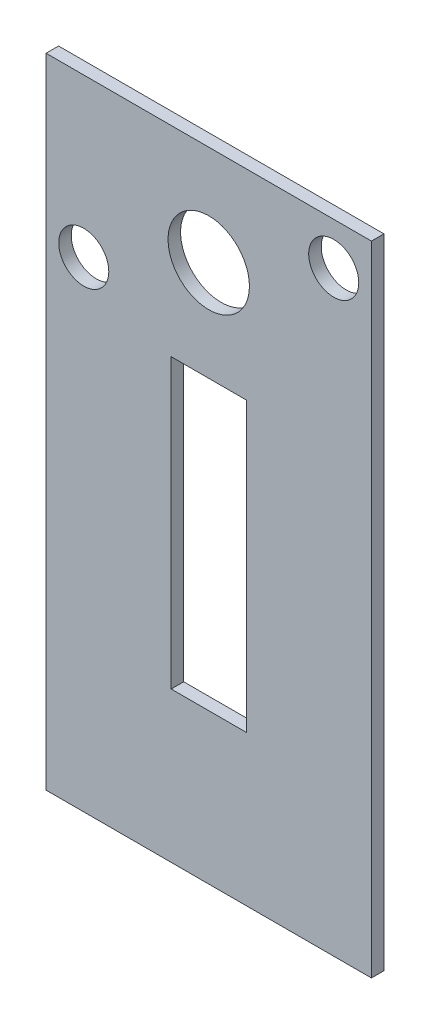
ISO-10303-21;
HEADER;
FILE_DESCRIPTION(('STEP AP214'),'2;1');
FILE_NAME('part.step','',(''),(''),'','','');
FILE_SCHEMA(('AUTOMOTIVE_DESIGN { 1 0 10303 214 1 1 1 1 }'));
ENDSEC;
DATA;
#1=APPLICATION_CONTEXT('core data for automotive mechanical design processes');
#2=APPLICATION_PROTOCOL_DEFINITION('international standard','automotive_design',2000,#1);
#3=PRODUCT_CONTEXT('',#1,'mechanical');
#4=PRODUCT('Part','Part','',(#3));
#5=PRODUCT_RELATED_PRODUCT_CATEGORY('part','',(#4));
#6=PRODUCT_DEFINITION_FORMATION('','',#4);
#7=PRODUCT_DEFINITION_CONTEXT('part definition',#1,'design');
#8=PRODUCT_DEFINITION('design','',#6,#7);
#9=PRODUCT_DEFINITION_SHAPE('','',#8);
#10=(LENGTH_UNIT() NAMED_UNIT(*) SI_UNIT(.MILLI.,.METRE.));
#11=(NAMED_UNIT(*) PLANE_ANGLE_UNIT() SI_UNIT($,.RADIAN.));
#12=(NAMED_UNIT(*) SI_UNIT($,.STERADIAN.) SOLID_ANGLE_UNIT());
#13=UNCERTAINTY_MEASURE_WITH_UNIT(LENGTH_MEASURE(1.E-05),#10,'distance_accuracy_value','');
#14=(GEOMETRIC_REPRESENTATION_CONTEXT(3) GLOBAL_UNCERTAINTY_ASSIGNED_CONTEXT((#13)) GLOBAL_UNIT_ASSIGNED_CONTEXT((#10,
#11,#12)) REPRESENTATION_CONTEXT('',''));
#15=CARTESIAN_POINT('',(0.,0.,0.));
#16=DIRECTION('',(0.,0.,1.));
#17=DIRECTION('',(1.,0.,0.));
#18=AXIS2_PLACEMENT_3D('',#15,#16,#17);
#19=CARTESIAN_POINT('',(6.5,-35.5,0.25));
#20=DIRECTION('',(0.,0.,-1.));
#21=DIRECTION('',(-1.,0.,0.));
#22=AXIS2_PLACEMENT_3D('',#19,#20,#21);
#23=PLANE('',#22);
#24=DIRECTION('',(1.,0.,0.));
#25=VECTOR('',#24,1.);
#26=CARTESIAN_POINT('',(1.5,-18.,0.25));
#27=LINE('',#26,#25);
#28=CARTESIAN_POINT('',(-1.5,-18.,0.25));
#29=VERTEX_POINT('',#28);
#30=CARTESIAN_POINT('',(1.5,-18.,0.25));
#31=VERTEX_POINT('',#30);
#32=EDGE_CURVE('E123',#29,#31,#27,.T.);
#33=ORIENTED_EDGE('',*,*,#32,.T.);
#34=DIRECTION('',(0.,-1.,0.));
#35=VECTOR('',#34,1.);
#36=CARTESIAN_POINT('',(1.5,-18.,0.25));
#37=LINE('',#36,#35);
#38=CARTESIAN_POINT('',(1.5,-29.5,0.25));
#39=VERTEX_POINT('',#38);
#40=EDGE_CURVE('E114',#31,#39,#37,.T.);
#41=ORIENTED_EDGE('',*,*,#40,.T.);
#42=DIRECTION('',(-1.,0.,0.));
#43=VECTOR('',#42,1.);
#44=CARTESIAN_POINT('',(1.5,-29.5,0.25));
#45=LINE('',#44,#43);
#46=CARTESIAN_POINT('',(-1.5,-29.5,0.25));
#47=VERTEX_POINT('',#46);
#48=EDGE_CURVE('E120',#39,#47,#45,.T.);
#49=ORIENTED_EDGE('',*,*,#48,.T.);
#50=DIRECTION('',(0.,1.,0.));
#51=VECTOR('',#50,1.);
#52=CARTESIAN_POINT('',(-1.5,-18.,0.25));
#53=LINE('',#52,#51);
#54=EDGE_CURVE('E45',#47,#29,#53,.T.);
#55=ORIENTED_EDGE('',*,*,#54,.T.);
#56=EDGE_LOOP('',(#33,#41,#49,#55));
#57=FACE_BOUND('',#56,.T.);
#58=CARTESIAN_POINT('',(0.,-14.,0.25));
#59=DIRECTION('',(0.,0.,1.));
#60=DIRECTION('',(1.,0.,0.));
#61=AXIS2_PLACEMENT_3D('',#58,#59,#60);
#62=CIRCLE('',#61,1.625);
#63=CARTESIAN_POINT('',(1.625,-14.,0.25));
#64=VERTEX_POINT('',#63);
#65=EDGE_CURVE('E154',#64,#64,#62,.T.);
#66=ORIENTED_EDGE('',*,*,#65,.F.);
#67=EDGE_LOOP('',(#66));
#68=FACE_BOUND('',#67,.T.);
#69=DIRECTION('',(1.,0.,0.));
#70=VECTOR('',#69,1.);
#71=CARTESIAN_POINT('',(6.5,-35.5,0.25));
#72=LINE('',#71,#70);
#73=CARTESIAN_POINT('',(-6.49999999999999,-35.5,0.25));
#74=VERTEX_POINT('',#73);
#75=CARTESIAN_POINT('',(6.5,-35.5,0.25));
#76=VERTEX_POINT('',#75);
#77=EDGE_CURVE('E160',#74,#76,#72,.T.);
#78=ORIENTED_EDGE('',*,*,#77,.T.);
#79=DIRECTION('',(0.,1.,0.));
#80=VECTOR('',#79,1.);
#81=CARTESIAN_POINT('',(6.5,-35.5,0.25));
#82=LINE('',#81,#80);
#83=CARTESIAN_POINT('',(6.5,-10.,0.25));
#84=VERTEX_POINT('',#83);
#85=EDGE_CURVE('E163',#76,#84,#82,.T.);
#86=ORIENTED_EDGE('',*,*,#85,.T.);
#87=DIRECTION('',(-1.,0.,0.));
#88=VECTOR('',#87,1.);
#89=CARTESIAN_POINT('',(-6.5,-10.,0.25));
#90=LINE('',#89,#88);
#91=CARTESIAN_POINT('',(-6.5,-10.,0.25));
#92=VERTEX_POINT('',#91);
#93=EDGE_CURVE('E165',#84,#92,#90,.T.);
#94=ORIENTED_EDGE('',*,*,#93,.T.);
#95=DIRECTION('',(0.,-1.,0.));
#96=VECTOR('',#95,1.);
#97=CARTESIAN_POINT('',(-6.5,-10.,0.25));
#98=LINE('',#97,#96);
#99=EDGE_CURVE('E167',#92,#74,#98,.T.);
#100=ORIENTED_EDGE('',*,*,#99,.T.);
#101=EDGE_LOOP('',(#78,#86,#94,#100));
#102=FACE_BOUND('',#101,.T.);
#103=CARTESIAN_POINT('',(-4.99377661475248,-16.3048199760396,0.25));
#104=DIRECTION('',(0.,0.,1.));
#105=DIRECTION('',(1.,0.,0.));
#106=AXIS2_PLACEMENT_3D('',#103,#104,#105);
#107=CIRCLE('',#106,0.999999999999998);
#108=CARTESIAN_POINT('',(-3.99377661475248,-16.3048199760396,0.25));
#109=VERTEX_POINT('',#108);
#110=EDGE_CURVE('E157',#109,#109,#107,.T.);
#111=ORIENTED_EDGE('',*,*,#110,.F.);
#112=EDGE_LOOP('',(#111));
#113=FACE_BOUND('',#112,.T.);
#114=CARTESIAN_POINT('',(4.99377661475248,-11.6951800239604,0.25));
#115=DIRECTION('',(0.,0.,1.));
#116=DIRECTION('',(1.,0.,0.));
#117=AXIS2_PLACEMENT_3D('',#114,#115,#116);
#118=CIRCLE('',#117,0.999999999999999);
#119=CARTESIAN_POINT('',(5.99377661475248,-11.6951800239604,0.25));
#120=VERTEX_POINT('',#119);
#121=EDGE_CURVE('E151',#120,#120,#118,.T.);
#122=ORIENTED_EDGE('',*,*,#121,.F.);
#123=EDGE_LOOP('',(#122));
#124=FACE_BOUND('',#123,.T.);
#125=ADVANCED_FACE('F30',(#57,#68,#102,#113,#124),#23,.F.);
#126=CARTESIAN_POINT('',(6.5,-35.5,0.25));
#127=DIRECTION('',(0.,1.,0.));
#128=DIRECTION('',(0.,0.,1.));
#129=AXIS2_PLACEMENT_3D('',#126,#127,#128);
#130=PLANE('',#129);
#131=DIRECTION('',(0.,0.,-1.));
#132=VECTOR('',#131,1.);
#133=CARTESIAN_POINT('',(-6.49999999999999,-35.5,0.25));
#134=LINE('',#133,#132);
#135=CARTESIAN_POINT('',(-6.49999999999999,-35.5,-0.25));
#136=VERTEX_POINT('',#135);
#137=EDGE_CURVE('E169',#74,#136,#134,.T.);
#138=ORIENTED_EDGE('',*,*,#137,.T.);
#139=DIRECTION('',(1.,0.,0.));
#140=VECTOR('',#139,1.);
#141=CARTESIAN_POINT('',(6.5,-35.5,-0.25));
#142=LINE('',#141,#140);
#143=CARTESIAN_POINT('',(6.5,-35.5,-0.25));
#144=VERTEX_POINT('',#143);
#145=EDGE_CURVE('E139',#136,#144,#142,.T.);
#146=ORIENTED_EDGE('',*,*,#145,.T.);
#147=DIRECTION('',(0.,0.,-1.));
#148=VECTOR('',#147,1.);
#149=CARTESIAN_POINT('',(6.5,-35.5,0.25));
#150=LINE('',#149,#148);
#151=EDGE_CURVE('E11',#76,#144,#150,.T.);
#152=ORIENTED_EDGE('',*,*,#151,.F.);
#153=ORIENTED_EDGE('',*,*,#77,.F.);
#154=EDGE_LOOP('',(#138,#146,#152,#153));
#155=FACE_BOUND('',#154,.T.);
#156=ADVANCED_FACE('F32',(#155),#130,.F.);
#157=CARTESIAN_POINT('',(6.5,-35.5,0.25));
#158=DIRECTION('',(-1.,0.,0.));
#159=DIRECTION('',(0.,0.,1.));
#160=AXIS2_PLACEMENT_3D('',#157,#158,#159);
#161=PLANE('',#160);
#162=ORIENTED_EDGE('',*,*,#151,.T.);
#163=DIRECTION('',(0.,1.,0.));
#164=VECTOR('',#163,1.);
#165=CARTESIAN_POINT('',(6.5,-35.5,-0.25));
#166=LINE('',#165,#164);
#167=CARTESIAN_POINT('',(6.5,-10.,-0.25));
#168=VERTEX_POINT('',#167);
#169=EDGE_CURVE('E142',#144,#168,#166,.T.);
#170=ORIENTED_EDGE('',*,*,#169,.T.);
#171=DIRECTION('',(0.,0.,-1.));
#172=VECTOR('',#171,1.);
#173=CARTESIAN_POINT('',(6.5,-10.,0.25));
#174=LINE('',#173,#172);
#175=EDGE_CURVE('E38',#84,#168,#174,.T.);
#176=ORIENTED_EDGE('',*,*,#175,.F.);
#177=ORIENTED_EDGE('',*,*,#85,.F.);
#178=EDGE_LOOP('',(#162,#170,#176,#177));
#179=FACE_BOUND('',#178,.T.);
#180=ADVANCED_FACE('F183',(#179),#161,.F.);
#181=CARTESIAN_POINT('',(-6.5,-10.,0.25));
#182=DIRECTION('',(0.,-1.,0.));
#183=DIRECTION('',(1.,0.,0.));
#184=AXIS2_PLACEMENT_3D('',#181,#182,#183);
#185=PLANE('',#184);
#186=ORIENTED_EDGE('',*,*,#175,.T.);
#187=DIRECTION('',(-1.,0.,0.));
#188=VECTOR('',#187,1.);
#189=CARTESIAN_POINT('',(-6.5,-10.,-0.25));
#190=LINE('',#189,#188);
#191=CARTESIAN_POINT('',(-6.5,-10.,-0.25));
#192=VERTEX_POINT('',#191);
#193=EDGE_CURVE('E145',#168,#192,#190,.T.);
#194=ORIENTED_EDGE('',*,*,#193,.T.);
#195=DIRECTION('',(0.,0.,-1.));
#196=VECTOR('',#195,1.);
#197=CARTESIAN_POINT('',(-6.5,-10.,0.25));
#198=LINE('',#197,#196);
#199=EDGE_CURVE('E171',#92,#192,#198,.T.);
#200=ORIENTED_EDGE('',*,*,#199,.F.);
#201=ORIENTED_EDGE('',*,*,#93,.F.);
#202=EDGE_LOOP('',(#186,#194,#200,#201));
#203=FACE_BOUND('',#202,.T.);
#204=ADVANCED_FACE('F176',(#203),#185,.F.);
#205=CARTESIAN_POINT('',(-6.5,-10.,0.25));
#206=DIRECTION('',(1.,0.,0.));
#207=DIRECTION('',(0.,1.,0.));
#208=AXIS2_PLACEMENT_3D('',#205,#206,#207);
#209=PLANE('',#208);
#210=ORIENTED_EDGE('',*,*,#199,.T.);
#211=DIRECTION('',(0.,-1.,0.));
#212=VECTOR('',#211,1.);
#213=CARTESIAN_POINT('',(-6.5,-10.,-0.25));
#214=LINE('',#213,#212);
#215=EDGE_CURVE('E148',#192,#136,#214,.T.);
#216=ORIENTED_EDGE('',*,*,#215,.T.);
#217=ORIENTED_EDGE('',*,*,#137,.F.);
#218=ORIENTED_EDGE('',*,*,#99,.F.);
#219=EDGE_LOOP('',(#210,#216,#217,#218));
#220=FACE_BOUND('',#219,.T.);
#221=ADVANCED_FACE('F189',(#220),#209,.F.);
#222=CARTESIAN_POINT('',(-4.99377661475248,-16.3048199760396,0.25));
#223=DIRECTION('',(0.,0.,-1.));
#224=DIRECTION('',(-1.,0.,0.));
#225=AXIS2_PLACEMENT_3D('',#222,#223,#224);
#226=CYLINDRICAL_SURFACE('',#225,0.999999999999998);
#227=ORIENTED_EDGE('',*,*,#110,.T.);
#228=EDGE_LOOP('',(#227));
#229=FACE_BOUND('',#228,.T.);
#230=CARTESIAN_POINT('',(-4.99377661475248,-16.3048199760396,-0.25));
#231=DIRECTION('',(0.,0.,1.));
#232=DIRECTION('',(1.,0.,0.));
#233=AXIS2_PLACEMENT_3D('',#230,#231,#232);
#234=CIRCLE('',#233,0.999999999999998);
#235=CARTESIAN_POINT('',(-3.99377661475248,-16.3048199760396,-0.25));
#236=VERTEX_POINT('',#235);
#237=EDGE_CURVE('E136',#236,#236,#234,.T.);
#238=ORIENTED_EDGE('',*,*,#237,.F.);
#239=EDGE_LOOP('',(#238));
#240=FACE_BOUND('',#239,.T.);
#241=ADVANCED_FACE('F214',(#229,#240),#226,.F.);
#242=CARTESIAN_POINT('',(0.,-14.,0.25));
#243=DIRECTION('',(0.,0.,-1.));
#244=DIRECTION('',(-1.,0.,0.));
#245=AXIS2_PLACEMENT_3D('',#242,#243,#244);
#246=CYLINDRICAL_SURFACE('',#245,1.625);
#247=ORIENTED_EDGE('',*,*,#65,.T.);
#248=EDGE_LOOP('',(#247));
#249=FACE_BOUND('',#248,.T.);
#250=CARTESIAN_POINT('',(0.,-14.,-0.25));
#251=DIRECTION('',(0.,0.,1.));
#252=DIRECTION('',(1.,0.,0.));
#253=AXIS2_PLACEMENT_3D('',#250,#251,#252);
#254=CIRCLE('',#253,1.625);
#255=CARTESIAN_POINT('',(1.625,-14.,-0.25));
#256=VERTEX_POINT('',#255);
#257=EDGE_CURVE('E133',#256,#256,#254,.T.);
#258=ORIENTED_EDGE('',*,*,#257,.F.);
#259=EDGE_LOOP('',(#258));
#260=FACE_BOUND('',#259,.T.);
#261=ADVANCED_FACE('F203',(#249,#260),#246,.F.);
#262=CARTESIAN_POINT('',(4.99377661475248,-11.6951800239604,0.25));
#263=DIRECTION('',(0.,0.,-1.));
#264=DIRECTION('',(-1.,0.,0.));
#265=AXIS2_PLACEMENT_3D('',#262,#263,#264);
#266=CYLINDRICAL_SURFACE('',#265,0.999999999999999);
#267=ORIENTED_EDGE('',*,*,#121,.T.);
#268=EDGE_LOOP('',(#267));
#269=FACE_BOUND('',#268,.T.);
#270=CARTESIAN_POINT('',(4.99377661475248,-11.6951800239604,-0.25));
#271=DIRECTION('',(0.,0.,1.));
#272=DIRECTION('',(1.,0.,0.));
#273=AXIS2_PLACEMENT_3D('',#270,#271,#272);
#274=CIRCLE('',#273,0.999999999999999);
#275=CARTESIAN_POINT('',(5.99377661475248,-11.6951800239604,-0.25));
#276=VERTEX_POINT('',#275);
#277=EDGE_CURVE('E128',#276,#276,#274,.T.);
#278=ORIENTED_EDGE('',*,*,#277,.F.);
#279=EDGE_LOOP('',(#278));
#280=FACE_BOUND('',#279,.T.);
#281=ADVANCED_FACE('F200',(#269,#280),#266,.F.);
#282=CARTESIAN_POINT('',(6.5,-35.5,-0.25));
#283=DIRECTION('',(0.,0.,-1.));
#284=DIRECTION('',(-1.,0.,0.));
#285=AXIS2_PLACEMENT_3D('',#282,#283,#284);
#286=PLANE('',#285);
#287=DIRECTION('',(0.,-1.,0.));
#288=VECTOR('',#287,1.);
#289=CARTESIAN_POINT('',(1.5,-18.,-0.25));
#290=LINE('',#289,#288);
#291=CARTESIAN_POINT('',(1.5,-18.,-0.25));
#292=VERTEX_POINT('',#291);
#293=CARTESIAN_POINT('',(1.5,-29.5,-0.25));
#294=VERTEX_POINT('',#293);
#295=EDGE_CURVE('E53',#292,#294,#290,.T.);
#296=ORIENTED_EDGE('',*,*,#295,.F.);
#297=DIRECTION('',(1.,0.,0.));
#298=VECTOR('',#297,1.);
#299=CARTESIAN_POINT('',(1.5,-18.,-0.25));
#300=LINE('',#299,#298);
#301=CARTESIAN_POINT('',(-1.5,-18.,-0.25));
#302=VERTEX_POINT('',#301);
#303=EDGE_CURVE('E112',#302,#292,#300,.T.);
#304=ORIENTED_EDGE('',*,*,#303,.F.);
#305=DIRECTION('',(0.,1.,0.));
#306=VECTOR('',#305,1.);
#307=CARTESIAN_POINT('',(-1.5,-18.,-0.25));
#308=LINE('',#307,#306);
#309=CARTESIAN_POINT('',(-1.5,-29.5,-0.25));
#310=VERTEX_POINT('',#309);
#311=EDGE_CURVE('E96',#310,#302,#308,.T.);
#312=ORIENTED_EDGE('',*,*,#311,.F.);
#313=DIRECTION('',(-1.,0.,0.));
#314=VECTOR('',#313,1.);
#315=CARTESIAN_POINT('',(1.5,-29.5,-0.25));
#316=LINE('',#315,#314);
#317=EDGE_CURVE('E105',#294,#310,#316,.T.);
#318=ORIENTED_EDGE('',*,*,#317,.F.);
#319=EDGE_LOOP('',(#296,#304,#312,#318));
#320=FACE_BOUND('',#319,.T.);
#321=ORIENTED_EDGE('',*,*,#277,.T.);
#322=EDGE_LOOP('',(#321));
#323=FACE_BOUND('',#322,.T.);
#324=ORIENTED_EDGE('',*,*,#257,.T.);
#325=EDGE_LOOP('',(#324));
#326=FACE_BOUND('',#325,.T.);
#327=ORIENTED_EDGE('',*,*,#237,.T.);
#328=EDGE_LOOP('',(#327));
#329=FACE_BOUND('',#328,.T.);
#330=ORIENTED_EDGE('',*,*,#145,.F.);
#331=ORIENTED_EDGE('',*,*,#215,.F.);
#332=ORIENTED_EDGE('',*,*,#193,.F.);
#333=ORIENTED_EDGE('',*,*,#169,.F.);
#334=EDGE_LOOP('',(#330,#331,#332,#333));
#335=FACE_BOUND('',#334,.T.);
#336=ADVANCED_FACE('F109',(#320,#323,#326,#329,#335),#286,.T.);
#337=CARTESIAN_POINT('',(1.5,-18.,0.25));
#338=DIRECTION('',(1.,0.,0.));
#339=DIRECTION('',(0.,1.,0.));
#340=AXIS2_PLACEMENT_3D('',#337,#338,#339);
#341=PLANE('',#340);
#342=ORIENTED_EDGE('',*,*,#295,.T.);
#343=DIRECTION('',(0.,0.,-1.));
#344=VECTOR('',#343,1.);
#345=CARTESIAN_POINT('',(1.5,-29.5,0.25));
#346=LINE('',#345,#344);
#347=EDGE_CURVE('E102',#39,#294,#346,.T.);
#348=ORIENTED_EDGE('',*,*,#347,.F.);
#349=ORIENTED_EDGE('',*,*,#40,.F.);
#350=DIRECTION('',(0.,0.,-1.));
#351=VECTOR('',#350,1.);
#352=CARTESIAN_POINT('',(1.5,-18.,0.25));
#353=LINE('',#352,#351);
#354=EDGE_CURVE('E126',#31,#292,#353,.T.);
#355=ORIENTED_EDGE('',*,*,#354,.T.);
#356=EDGE_LOOP('',(#342,#348,#349,#355));
#357=FACE_BOUND('',#356,.T.);
#358=ADVANCED_FACE('F208',(#357),#341,.F.);
#359=CARTESIAN_POINT('',(1.5,-18.,0.25));
#360=DIRECTION('',(0.,1.,0.));
#361=DIRECTION('',(-1.,0.,0.));
#362=AXIS2_PLACEMENT_3D('',#359,#360,#361);
#363=PLANE('',#362);
#364=ORIENTED_EDGE('',*,*,#303,.T.);
#365=ORIENTED_EDGE('',*,*,#354,.F.);
#366=ORIENTED_EDGE('',*,*,#32,.F.);
#367=DIRECTION('',(0.,0.,-1.));
#368=VECTOR('',#367,1.);
#369=CARTESIAN_POINT('',(-1.5,-18.,0.25));
#370=LINE('',#369,#368);
#371=EDGE_CURVE('E101',#29,#302,#370,.T.);
#372=ORIENTED_EDGE('',*,*,#371,.T.);
#373=EDGE_LOOP('',(#364,#365,#366,#372));
#374=FACE_BOUND('',#373,.T.);
#375=ADVANCED_FACE('F282',(#374),#363,.F.);
#376=CARTESIAN_POINT('',(-1.5,-18.,0.25));
#377=DIRECTION('',(-1.,0.,0.));
#378=DIRECTION('',(0.,-1.,0.));
#379=AXIS2_PLACEMENT_3D('',#376,#377,#378);
#380=PLANE('',#379);
#381=ORIENTED_EDGE('',*,*,#311,.T.);
#382=ORIENTED_EDGE('',*,*,#371,.F.);
#383=ORIENTED_EDGE('',*,*,#54,.F.);
#384=DIRECTION('',(0.,0.,-1.));
#385=VECTOR('',#384,1.);
#386=CARTESIAN_POINT('',(-1.5,-29.5,0.25));
#387=LINE('',#386,#385);
#388=EDGE_CURVE('E92',#47,#310,#387,.T.);
#389=ORIENTED_EDGE('',*,*,#388,.T.);
#390=EDGE_LOOP('',(#381,#382,#383,#389));
#391=FACE_BOUND('',#390,.T.);
#392=ADVANCED_FACE('F94',(#391),#380,.F.);
#393=CARTESIAN_POINT('',(1.5,-29.5,0.25));
#394=DIRECTION('',(0.,-1.,0.));
#395=DIRECTION('',(0.,0.,-1.));
#396=AXIS2_PLACEMENT_3D('',#393,#394,#395);
#397=PLANE('',#396);
#398=ORIENTED_EDGE('',*,*,#317,.T.);
#399=ORIENTED_EDGE('',*,*,#388,.F.);
#400=ORIENTED_EDGE('',*,*,#48,.F.);
#401=ORIENTED_EDGE('',*,*,#347,.T.);
#402=EDGE_LOOP('',(#398,#399,#400,#401));
#403=FACE_BOUND('',#402,.T.);
#404=ADVANCED_FACE('F106',(#403),#397,.F.);
#405=CLOSED_SHELL('',(#125,#156,#180,#204,#221,#241,#261,#281,#336,#358,#375,#392,#404));
#406=MANIFOLD_SOLID_BREP('B2',#405);
#407=ADVANCED_BREP_SHAPE_REPRESENTATION('',(#18,#406),#14);
#408=SHAPE_DEFINITION_REPRESENTATION(#9,#407);
ENDSEC;
END-ISO-10303-21;
